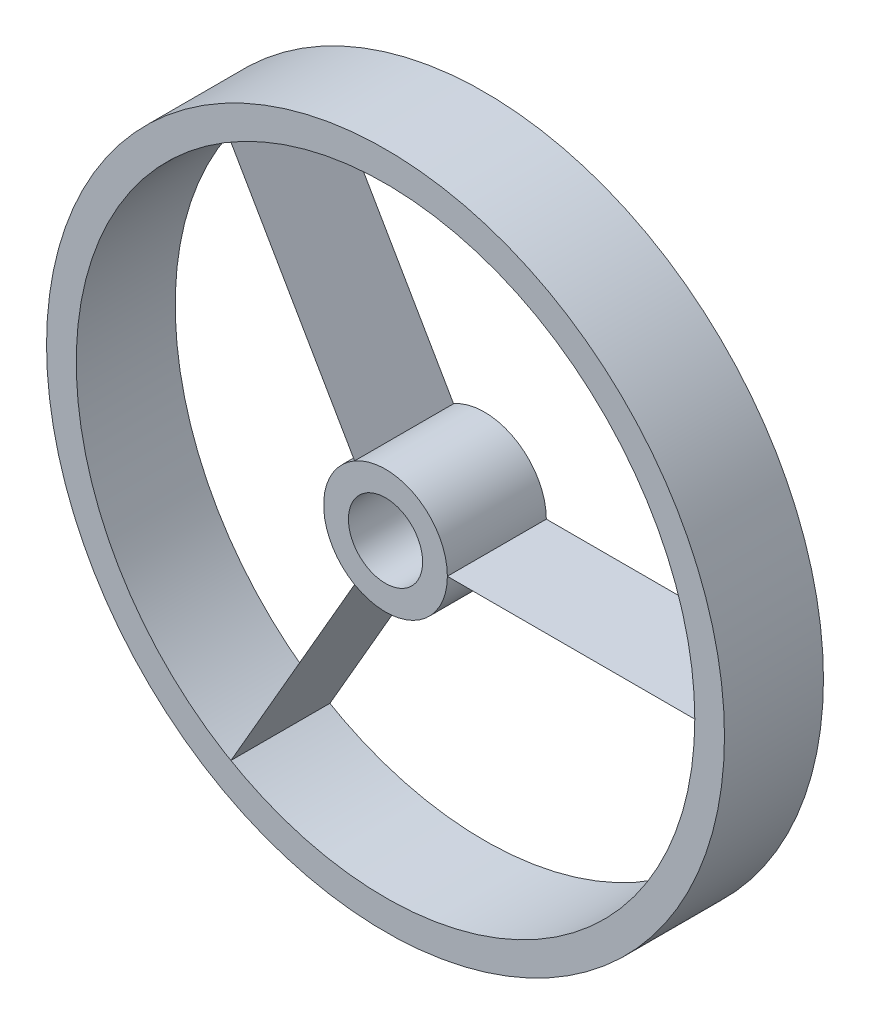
from build123d import *

# Parameters (mm, degrees)
SKETCH4_R            = 25
EXTRUDE2_DEPTH       = 40
SKETCH13_R           = 15
EXTRUDE6_DEPTH       = 54.38539126
SKETCH5_W            = 100
SKETCH5_H            = 2
EXTRUDE_THIN1_DEPTH  = 40
EXTRUDE_THIN7_DEPTH  = 40
EXTRUDE_THIN8_DEPTH  = 40
SKETCH18_R           = 137
SKETCH18_R_2         = 125
EXTRUDE_THIN10_DEPTH = 40


with BuildPart() as part:
    # Sketch4 → Extrude2 (new body)
    with BuildSketch(Plane.XY):
        Circle(SKETCH4_R)
    extrude(amount=EXTRUDE2_DEPTH)

    # Sketch13 → Extrude6 (cut, through all)
    with BuildSketch(Plane.XY.offset(40)):
        Circle(SKETCH13_R)
    extrude(amount=-EXTRUDE6_DEPTH, mode=Mode.SUBTRACT)


with BuildPart() as body_2:
    # Sketch5 → Extrude-Thin1 (new, through all)
    with BuildSketch(Plane.XY):
        with Locations((75, 0)):
            Rectangle(SKETCH5_W, SKETCH5_H)
    extrude(amount=EXTRUDE_THIN1_DEPTH)


with BuildPart() as body_3:
    # Sketch15 → Extrude-Thin7 (new, through all)
    with BuildSketch(Plane.XY):
        Polygon((-11.633974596, 22.150635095), (-61.633974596, 108.753175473), (-63.366025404, 107.753175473), (-13.366025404, 21.150635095), align=None)
    extrude(amount=EXTRUDE_THIN7_DEPTH)


with BuildPart() as body_4:
    # Sketch16 → Extrude-Thin8 (new, through all)
    with BuildSketch(Plane.XY):
        Polygon((-13.366025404, -21.150635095), (-63.366025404, -107.753175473), (-61.633974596, -108.753175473), (-11.633974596, -22.150635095), align=None)
    extrude(amount=EXTRUDE_THIN8_DEPTH)


with BuildPart() as body_5:
    # Sketch18 → Extrude-Thin10 (new, through all)
    with BuildSketch(Plane.XY):
        Circle(SKETCH18_R)
        Circle(SKETCH18_R_2, mode=Mode.SUBTRACT)
    extrude(amount=EXTRUDE_THIN10_DEPTH)


solid = Compound([part.part, body_5.part])
